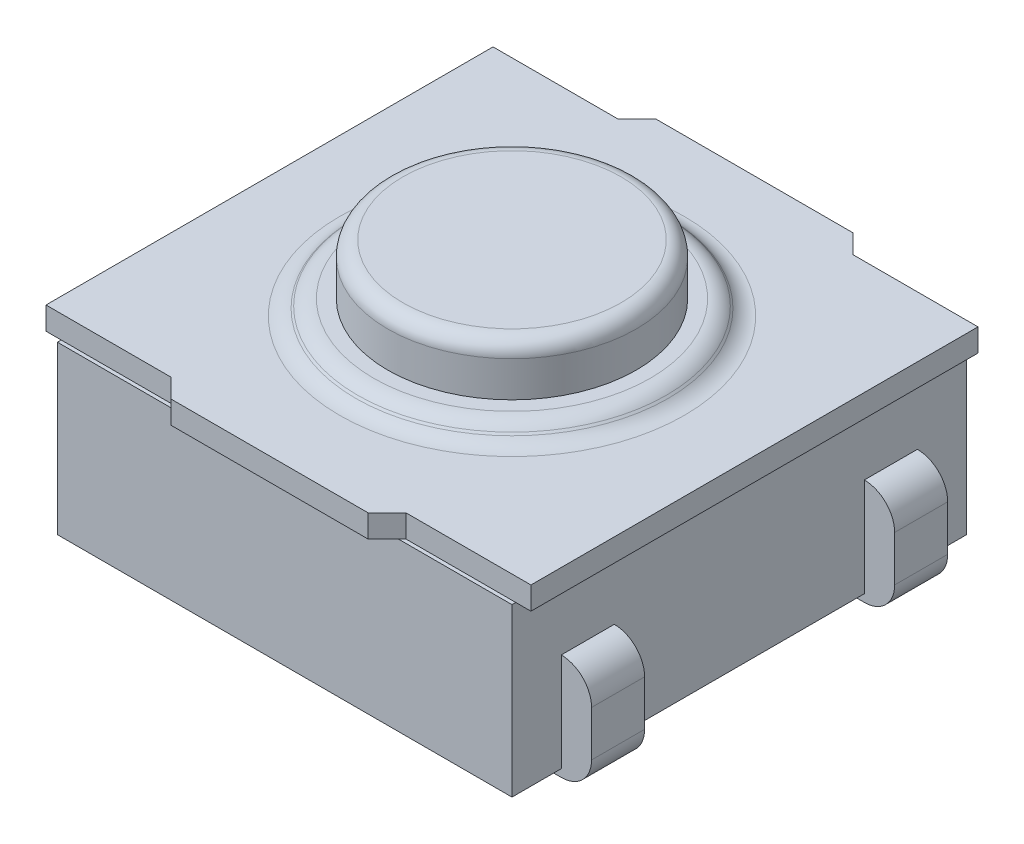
from build123d import *

# Parameters (mm, degrees)
EXTRUDE_START   = 0.1
SKETCH_1_W      = 6
SKETCH_1_H      = 6
EXTRUDE_1_DEPTH = 2.2
EXTRUDE_2_DEPTH = 0.3
SKETCH_5_W      = 1.64
SKETCH_5_H      = 0.67
EXTRUDE_START_2 = 2
EXTRUDE_3_DEPTH = 0.35
FILLET_1_R      = 0.2
FILLET_2_R      = 0.3


with BuildPart() as part:
    # Sketch 1 → Extrude 1 (new body)
    with BuildSketch(Plane(origin=(0, 0, 0), x_dir=(1, 0, 0), z_dir=(0, 1, 0)).offset(EXTRUDE_START)):
        Rectangle(SKETCH_1_W, SKETCH_1_H)
    extrude(amount=EXTRUDE_1_DEPTH)

    # Sketch 2 → Extrude 2 (add)
    with BuildSketch(Plane(origin=(0, 2.3, 0), x_dir=(-1, 0, 0), z_dir=(0, 1, 0))):
        Polygon((3.2, 2.95), (1.55, 2.95), (1.3, 3.2), (-1.3, 3.2), (-1.55, 2.95), (-3.2, 2.95), (-3.2, -2.95), (-1.55, -2.95), (-1.3, -3.2), (1.3, -3.2), (1.55, -2.95), (3.2, -2.95), align=None)
    extrude(amount=EXTRUDE_2_DEPTH)

    # Sketch 3 → Revolve 1 (revolve)
    with BuildSketch(Plane.XY, mode=Mode.PRIVATE) as revolve_1_sk:
        Polygon((0, 2.6), (-2.15, 2.6), (-1.95, 2.8), (0, 2.8), align=None)
    revolve(revolve_1_sk.sketch.rotate(Axis((0, 2.8, 0), (0, -1, 0)), 270), axis=Axis((0, 2.8, 0), (0, -1, 0)))

    # Sketch 5 → Revolve 2 (revolve)
    with BuildSketch(Plane.XY, mode=Mode.PRIVATE) as revolve_2_sk:
        with Locations((-0.82, 3.135)):
            Rectangle(SKETCH_5_W, SKETCH_5_H)
    revolve(revolve_2_sk.sketch.rotate(Axis((0, 3.47, 0), (0, -1, 0)), 270), axis=Axis((0, 3.47, 0), (0, -1, 0)))

    # Sketch 4 → Extrude 3 (add, symmetric)
    with BuildSketch(Plane.XY.offset(EXTRUDE_START_2)):
        with BuildLine():
            Line((-3, 1.4), (-3, 0.4))
            Line((-3, 0.4), (-1.4, 0.4))
            ThreePointArc((-1.4, 0.4), (-1.517157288, 0.117157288), (-1.8, 0))
            Line((-1.8, 0), (-3, 0))
            ThreePointArc((-3, 0), (-3.282842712, 0.117157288), (-3.4, 0.4))
            Line((-3.4, 0.4), (-3.4, 1))
            ThreePointArc((-3.4, 1), (-3.282842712, 1.282842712), (-3, 1.4))
        make_face()
        with BuildLine():
            Line((3.4, 0.4), (3.4, 1))
            ThreePointArc((3.4, 1), (3.282842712, 1.282842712), (3, 1.4))
            Line((3, 1.4), (3, 0.4))
            Line((3, 0.4), (1.4, 0.4))
            ThreePointArc((1.4, 0.4), (1.517157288, 0.117157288), (1.8, 0))
            Line((1.8, 0), (3, 0))
            ThreePointArc((3, 0), (3.282842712, 0.117157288), (3.4, 0.4))
        make_face()
    extrude_3 = extrude(amount=EXTRUDE_3_DEPTH, both=True)

    # Mirror 1: Extrude 3 across plane
    add(extrude_3.mirror(Plane.XY))

    # Fillet 1
    fillet_1_edges = [part.edges().sort_by_distance(p)[0] for p in [
        (0, 3.47, -1.64),
    ]]
    fillet(fillet_1_edges, radius=FILLET_1_R)

    # Fillet 2
    fillet_2_edges = [part.edges().sort_by_distance(p)[0] for p in [
        (0, 2.6, -2.15),
        (0, 2.8, -1.95),
    ]]
    fillet(fillet_2_edges, radius=FILLET_2_R)


solid = part.part
